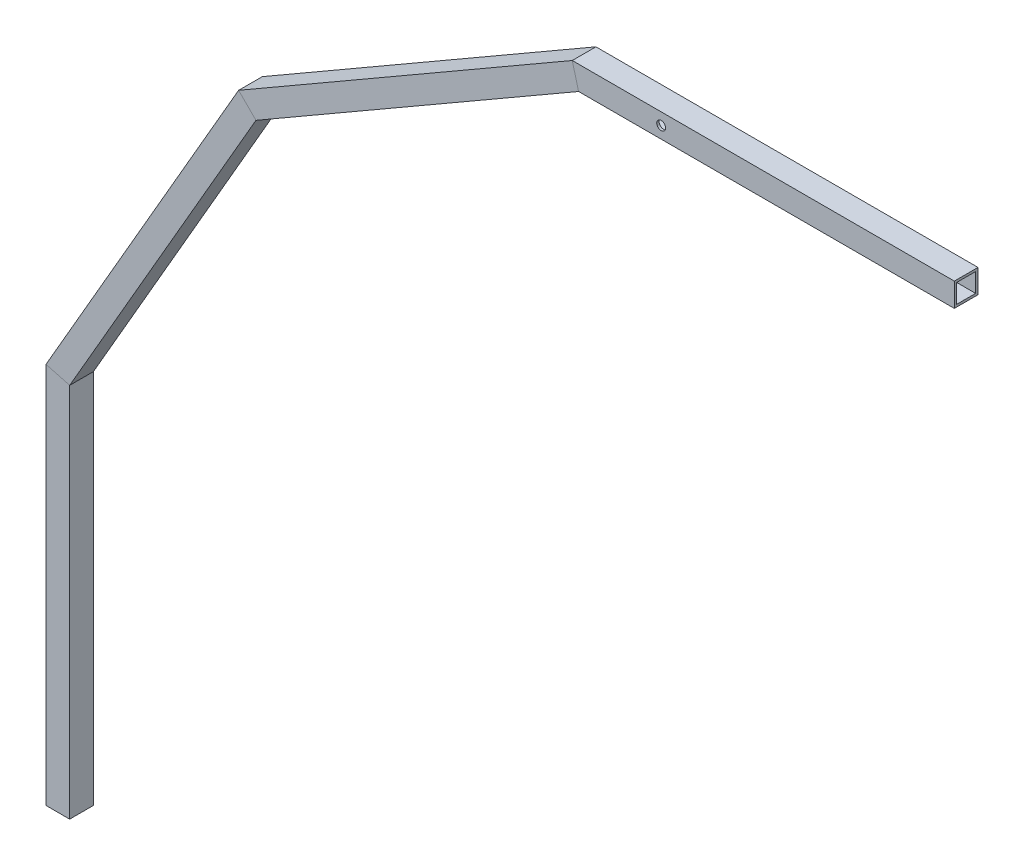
from build123d import *

# Parameters (mm, degrees)
SKETCH2_W          = 25.4
SKETCH2_H          = 25.4
SKETCH2_W_2        = 20.32
SKETCH2_H_2        = 20.32
SKETCH3_R          = 4.7625
CUT_EXTRUDE1_DEPTH = 1370.086254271


with BuildPart() as part:
    # Sweep1: sweep along a path in Sketch1
    with BuildLine(Plane.XY) as sweep1_path:
        Line((0, 0), (0, 406.4))
        Line((0, 406.4), (203.2, 758.352724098))
        Line((203.2, 758.352724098), (555.152724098, 961.552724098))
        Line((555.152724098, 961.552724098), (961.552724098, 961.552724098))
    # Sketch2 → Sweep1 (sweep)
    with BuildSketch(Plane(origin=(0, 0, 0), x_dir=(1, 0, 0), z_dir=(0, 1, 0))):
        Rectangle(SKETCH2_W, SKETCH2_H)
        Rectangle(SKETCH2_W_2, SKETCH2_H_2, mode=Mode.SUBTRACT)
    sweep(path=sweep1_path.line, transition=Transition.RIGHT)

    # Sketch3 → Cut-Extrude1 (cut, through all)
    with BuildSketch(Plane.XY.offset(12.7)):
        with Locations((647.126769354, 961.552724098)):
            Circle(SKETCH3_R)
    extrude(amount=-CUT_EXTRUDE1_DEPTH, mode=Mode.SUBTRACT)


solid = part.part
